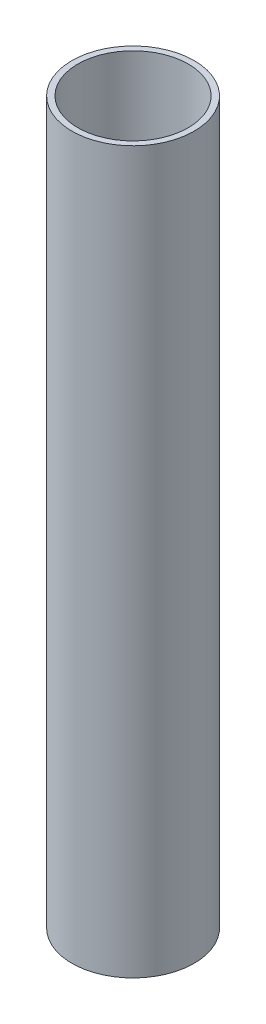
from build123d import *

# Parameters (mm, degrees)
SKETCH1_R           = 10.35
SKETCH1_R_2         = 9.35
BOSS_EXTRUDE1_DEPTH = 122


with BuildPart() as part:
    # Sketch1 → Boss-Extrude1 (new body)
    with BuildSketch(Plane(origin=(0, 0, 0), x_dir=(1, 0, 0), z_dir=(0, 1, 0))):
        with Locations(Location((0, 0, 0), (0, 0, 90))):
            Circle(SKETCH1_R)
        with Locations(Location((0, 0, 0), (0, 0, 90))):
            Circle(SKETCH1_R_2, mode=Mode.SUBTRACT)
    extrude(amount=BOSS_EXTRUDE1_DEPTH)


solid = part.part
